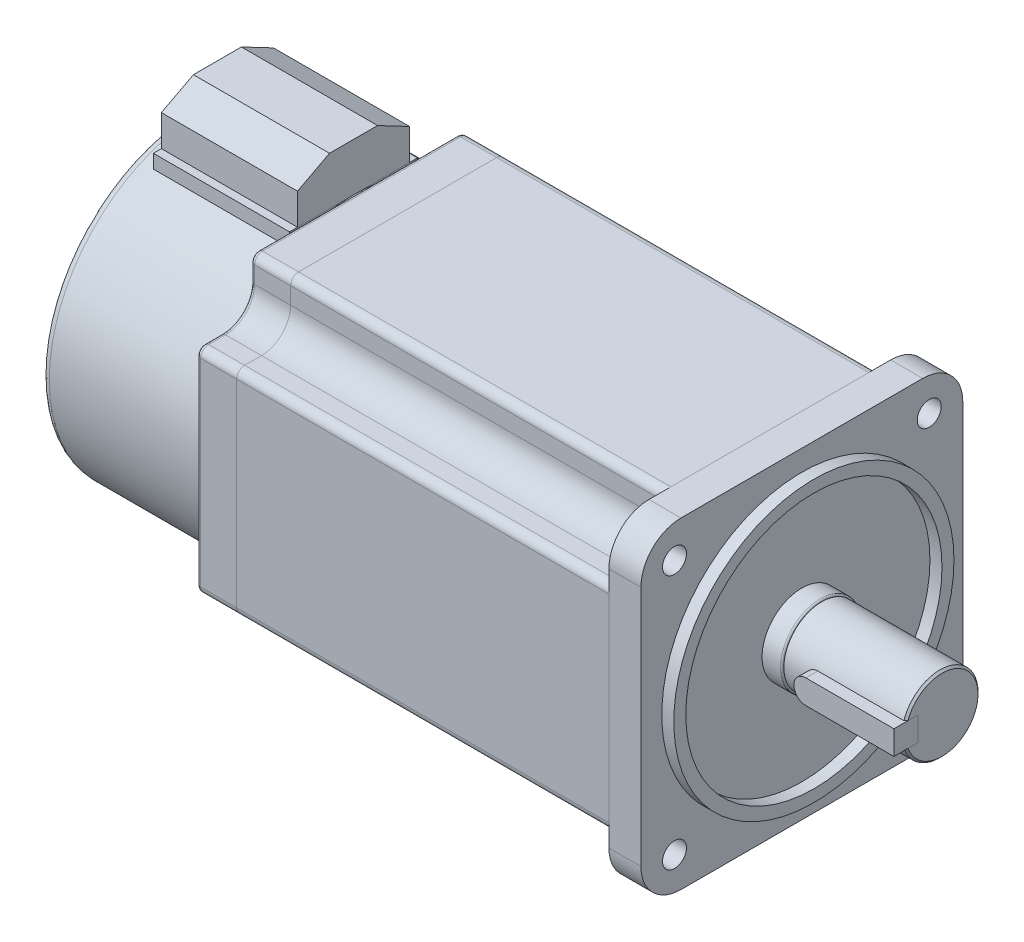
from build123d import *

# Parameters (mm, degrees)
EXTRUDE_1_DEPTH     = 8
EXTRUDE_2_DEPTH     = 93
EXTRUDE_3_DEPTH     = 10
CUT_EXTRUDE_1_DEPTH = 103
FILLET_1_R          = 1
SKETCH_5_R          = 3
CUT_EXTRUDE_2_DEPTH = 8
SKETCH_6_R          = 35
SKETCH_6_R_2        = 32
EXTRUDE_4_DEPTH     = 3
SKETCH_7_R          = 9.95
EXTRUDE_5_DEPTH     = 5
FILLET_2_R          = 0.4
SKETCH_8_R          = 9.5
EXTRUDE_6_DEPTH     = 30
CUT_EXTRUDE_3_DEPTH = 3.5
EXTRUDE_7_DEPTH     = 6
CHAMFER_1_SIZE      = 0.5
SKETCH_11_R         = 39
EXTRUDE_8_DEPTH     = 40
FILLET_3_R          = 2
SKETCH_27_W         = 34
SKETCH_27_H         = 32
CUT_EXTRUDE_6_DEPTH = 10
SKETCH_29_W         = 34
SKETCH_29_H         = 32
EXTRUDE_11_DEPTH    = 10
SKETCH_30_W         = 34
SKETCH_30_H         = 28
EXTRUDE_12_DEPTH    = 12
CUT_EXTRUDE_7_DEPTH = 34


with BuildPart() as part:
    # Sketch 1 → Extrude 1 (new body)
    with BuildSketch(Plane(origin=(0, 0, 0), x_dir=(0, 0, -1), z_dir=(1, 0, 0))):
        with BuildLine():
            Line((-30.2, -40.2), (30.2, -40.2))
            ThreePointArc((30.2, -40.2), (37.271067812, -37.271067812), (40.2, -30.2))
            Line((40.2, -30.2), (40.2, 30.2))
            ThreePointArc((40.2, 30.2), (37.271067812, 37.271067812), (30.2, 40.2))
            Line((30.2, 40.2), (-30.2, 40.2))
            ThreePointArc((-30.2, 40.2), (-37.271067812, 37.271067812), (-40.2, 30.2))
            Line((-40.2, 30.2), (-40.2, -30.2))
            ThreePointArc((-40.2, -30.2), (-37.271067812, -37.271067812), (-30.2, -40.2))
        make_face()
    extrude(amount=EXTRUDE_1_DEPTH)

    # Sketch 5 → Cut-Extrude 2 (cut)
    with BuildSketch(Plane(origin=(8, 0, 0), x_dir=(0, 0, -1), z_dir=(1, 0, 0))):
        with Locations((-31.819805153, 31.819805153)):
            Circle(SKETCH_5_R)
        with Locations((31.819805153, 31.819805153)):
            Circle(SKETCH_5_R)
        with Locations((-31.819805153, -31.819805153)):
            Circle(SKETCH_5_R)
        with Locations((31.819805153, -31.819805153)):
            Circle(SKETCH_5_R)
    extrude(amount=-CUT_EXTRUDE_2_DEPTH, mode=Mode.SUBTRACT)

    # Sketch 6 → Extrude 4 (add)
    with BuildSketch(Plane(origin=(8, 0, 0), x_dir=(0, 0, -1), z_dir=(1, 0, 0))):
        Circle(SKETCH_6_R)
        Circle(SKETCH_6_R_2, mode=Mode.SUBTRACT)
    extrude(amount=EXTRUDE_4_DEPTH)

    # Sketch 7 → Extrude 5 (add)
    with BuildSketch(Plane(origin=(8, 0, 0), x_dir=(0, 0, -1), z_dir=(1, 0, 0))):
        Circle(SKETCH_7_R)
    extrude(amount=EXTRUDE_5_DEPTH)

    # Fillet 2
    fillet_2_edges = [part.edges().sort_by_distance(p)[0] for p in [
        (13, 0, 9.95),
    ]]
    fillet(fillet_2_edges, radius=FILLET_2_R)


with BuildPart() as body_2:
    # Sketch 2 → Extrude 2 (new body)
    with BuildSketch(Plane.ZY):
        with BuildLine():
            Line((-30.2, -40.2), (30.2, -40.2))
            ThreePointArc((30.2, -40.2), (37.271067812, -37.271067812), (40.2, -30.2))
            Line((40.2, -30.2), (40.2, 30.2))
            ThreePointArc((40.2, 30.2), (37.271067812, 37.271067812), (30.2, 40.2))
            Line((30.2, 40.2), (-30.2, 40.2))
            ThreePointArc((-30.2, 40.2), (-37.271067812, 37.271067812), (-40.2, 30.2))
            Line((-40.2, 30.2), (-40.2, -30.2))
            ThreePointArc((-40.2, -30.2), (-37.271067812, -37.271067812), (-30.2, -40.2))
        make_face()
    extrude(amount=EXTRUDE_2_DEPTH)


with BuildPart() as body_3:
    # Sketch 3 → Extrude 3 (new body)
    with BuildSketch(Plane.ZY.offset(93)):
        with BuildLine():
            Line((-30.2, -40.2), (30.2, -40.2))
            ThreePointArc((30.2, -40.2), (37.271067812, -37.271067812), (40.2, -30.2))
            Line((40.2, -30.2), (40.2, 30.2))
            ThreePointArc((40.2, 30.2), (37.271067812, 37.271067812), (30.2, 40.2))
            Line((30.2, 40.2), (-30.2, 40.2))
            ThreePointArc((-30.2, 40.2), (-37.271067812, 37.271067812), (-40.2, 30.2))
            Line((-40.2, 30.2), (-40.2, -30.2))
            ThreePointArc((-40.2, -30.2), (-37.271067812, -37.271067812), (-30.2, -40.2))
        make_face()
    extrude(amount=EXTRUDE_3_DEPTH)


with BuildPart() as cut_extrude_1_tool:
    # Sketch 4 → Cut-Extrude 1 (new body)
    with BuildSketch(Plane.ZY.offset(103)):
        with BuildLine():
            Line((-34, -26.728136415), (-38.2, -26.728136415))
            ThreePointArc((-38.2, -26.728136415), (-39.614213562, -26.142349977), (-40.2, -24.728136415))
            Line((-40.2, -24.728136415), (-40.2, -30.2))
            ThreePointArc((-40.2, -30.2), (-37.271067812, -37.271067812), (-30.2, -40.2))
            Line((-30.2, -40.2), (-24.728136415, -40.2))
            ThreePointArc((-24.728136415, -40.2), (-26.142349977, -39.614213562), (-26.728136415, -38.2))
            Line((-26.728136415, -38.2), (-26.728136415, -34))
            ThreePointArc((-26.728136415, -34), (-28.858015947, -28.858015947), (-34, -26.728136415))
        make_face()
        with BuildLine():
            Line((-40.2, 24.728136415), (-40.2, 30.2))
            ThreePointArc((-40.2, 30.2), (-37.271067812, 37.271067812), (-30.2, 40.2))
            Line((-30.2, 40.2), (-24.728136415, 40.2))
            ThreePointArc((-24.728136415, 40.2), (-26.142349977, 39.614213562), (-26.728136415, 38.2))
            Line((-26.728136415, 38.2), (-26.728136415, 34))
            ThreePointArc((-26.728136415, 34), (-28.858015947, 28.858015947), (-34, 26.728136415))
            Line((-34, 26.728136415), (-38.2, 26.728136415))
            ThreePointArc((-38.2, 26.728136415), (-39.614213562, 26.142349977), (-40.2, 24.728136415))
        make_face()
        with BuildLine():
            Line((24.728136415, 40.2), (30.2, 40.2))
            ThreePointArc((30.2, 40.2), (37.271067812, 37.271067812), (40.2, 30.2))
            Line((40.2, 30.2), (40.2, 24.728136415))
            ThreePointArc((40.2, 24.728136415), (39.614213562, 26.142349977), (38.2, 26.728136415))
            Line((38.2, 26.728136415), (34, 26.728136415))
            ThreePointArc((34, 26.728136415), (28.858015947, 28.858015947), (26.728136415, 34))
            Line((26.728136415, 34), (26.728136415, 38.2))
            ThreePointArc((26.728136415, 38.2), (26.142349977, 39.614213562), (24.728136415, 40.2))
        make_face()
        with BuildLine():
            Line((40.2, -24.728136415), (40.2, -30.2))
            ThreePointArc((40.2, -30.2), (37.271067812, -37.271067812), (30.2, -40.2))
            Line((30.2, -40.2), (24.728136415, -40.2))
            ThreePointArc((24.728136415, -40.2), (26.142349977, -39.614213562), (26.728136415, -38.2))
            Line((26.728136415, -38.2), (26.728136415, -34))
            ThreePointArc((26.728136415, -34), (28.858015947, -28.858015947), (34, -26.728136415))
            Line((34, -26.728136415), (38.2, -26.728136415))
            ThreePointArc((38.2, -26.728136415), (39.614213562, -26.142349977), (40.2, -24.728136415))
        make_face()
    extrude(amount=-CUT_EXTRUDE_1_DEPTH)


with BuildPart() as body_2_1:
    add(body_2.part)

    # Cut-Extrude 1: cut by cut_extrude_1_tool
    add(cut_extrude_1_tool.part, mode=Mode.SUBTRACT)


with BuildPart() as body_3_1:
    add(body_3.part)

    # Cut-Extrude 1: cut by cut_extrude_1_tool
    add(cut_extrude_1_tool.part, mode=Mode.SUBTRACT)

    # Fillet 1
    fillet_1_edges = [body_3_1.edges().sort_by_distance(p)[0] for p in [
        (-103, -28.858015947, 28.858015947),
        (-103, -36.1, 26.728136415),
        (-103, -39.614213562, 26.142349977),
        (-103, -26.142349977, 39.614213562),
        (-103, -26.728136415, 36.1),
        (-103, 40.2, 0),
        (-103, 0, -40.2),
        (-103, -40.2, 0),
        (-103, 0, 40.2),
        (-103, -28.858015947, -28.858015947),
        (-103, -26.728136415, -36.1),
        (-103, -26.142349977, -39.614213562),
        (-103, -39.614213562, -26.142349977),
        (-103, -36.1, -26.728136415),
        (-103, 28.858015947, -28.858015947),
        (-103, 36.1, -26.728136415),
        (-103, 39.614213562, -26.142349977),
        (-103, 26.142349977, -39.614213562),
        (-103, 26.728136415, -36.1),
        (-103, 28.858015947, 28.858015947),
        (-103, 26.728136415, 36.1),
        (-103, 26.142349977, 39.614213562),
        (-103, 39.614213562, 26.142349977),
        (-103, 36.1, 26.728136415),
    ]]
    fillet(fillet_1_edges, radius=FILLET_1_R)


with BuildPart() as body_4:
    # Sketch 8 → Extrude 6 (new body)
    with BuildSketch(Plane(origin=(13, 0, 0), x_dir=(0, 0, -1), z_dir=(1, 0, 0))):
        Circle(SKETCH_8_R)
    extrude(amount=EXTRUDE_6_DEPTH)

    # Sketch 9 → Cut-Extrude 3 (cut)
    with BuildSketch(Plane.XY.offset(9.5)):
        with BuildLine():
            Line((21, 3), (43, 3))
            Line((43, 3), (43, -3))
            Line((43, -3), (21, -3))
            ThreePointArc((21, -3), (18, 0), (21, 3))
        make_face()
    extrude(amount=-CUT_EXTRUDE_3_DEPTH, mode=Mode.SUBTRACT)

    # Chamfer 1
    chamfer_1_edges = [body_4.edges().sort_by_distance(p)[0] for p in [
        (43, 9.377682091, -1.519565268),
    ]]
    chamfer(chamfer_1_edges, length=CHAMFER_1_SIZE)


with BuildPart() as body_5:
    # Sketch 10 → Extrude 7 (new body)
    with BuildSketch(Plane.XY.offset(6)):
        with BuildLine():
            Line((21, 3), (43, 3))
            Line((43, 3), (43, -3))
            Line((43, -3), (21, -3))
            ThreePointArc((21, -3), (18, 0), (21, 3))
        make_face()
    extrude(amount=EXTRUDE_7_DEPTH)


with BuildPart() as body_6:
    # Sketch 11 → Extrude 8 (new body)
    with BuildSketch(Plane.ZY.offset(103)):
        Circle(SKETCH_11_R)
    extrude(amount=EXTRUDE_8_DEPTH)

    # Fillet 3
    fillet_3_edges = [body_6.edges().sort_by_distance(p)[0] for p in [
        (-143, 0, -39),
    ]]
    fillet(fillet_3_edges, radius=FILLET_3_R)

    # Sketch 27 → Cut-Extrude 6 (cut)
    with BuildSketch(Plane(origin=(0, 39, 0), x_dir=(1, 0, 0), z_dir=(0, 1, 0))):
        with Locations((-121, 0)):
            Rectangle(SKETCH_27_W, SKETCH_27_H)
    extrude(amount=-CUT_EXTRUDE_6_DEPTH, mode=Mode.SUBTRACT)

    # Sketch 29 → Extrude 11 (add)
    with BuildSketch(Plane(origin=(0, 29, 0), x_dir=(1, 0, 0), z_dir=(0, 1, 0))):
        with Locations((-121, 0)):
            Rectangle(SKETCH_29_W, SKETCH_29_H)
    extrude(amount=EXTRUDE_11_DEPTH)


with BuildPart() as body_7:
    # Sketch 30 → Extrude 12 (new body)
    with BuildSketch(Plane(origin=(0, 39, 0), x_dir=(1, 0, 0), z_dir=(0, 1, 0))):
        with Locations((-121, 0)):
            Rectangle(SKETCH_30_W, SKETCH_30_H)
    extrude(amount=EXTRUDE_12_DEPTH)

    # Sketch 31 → Cut-Extrude 7 (cut)
    with BuildSketch(Plane.ZY.offset(138)):
        Polygon((-14, 51), (-14, 46.8), (-6, 51), align=None)
        Polygon((14, 51), (6, 51), (14, 46.8), align=None)
    extrude(amount=-CUT_EXTRUDE_7_DEPTH, mode=Mode.SUBTRACT)


solid = Compound([part.part, body_2_1.part, body_3_1.part, body_4.part, body_5.part, body_6.part, body_7.part])
